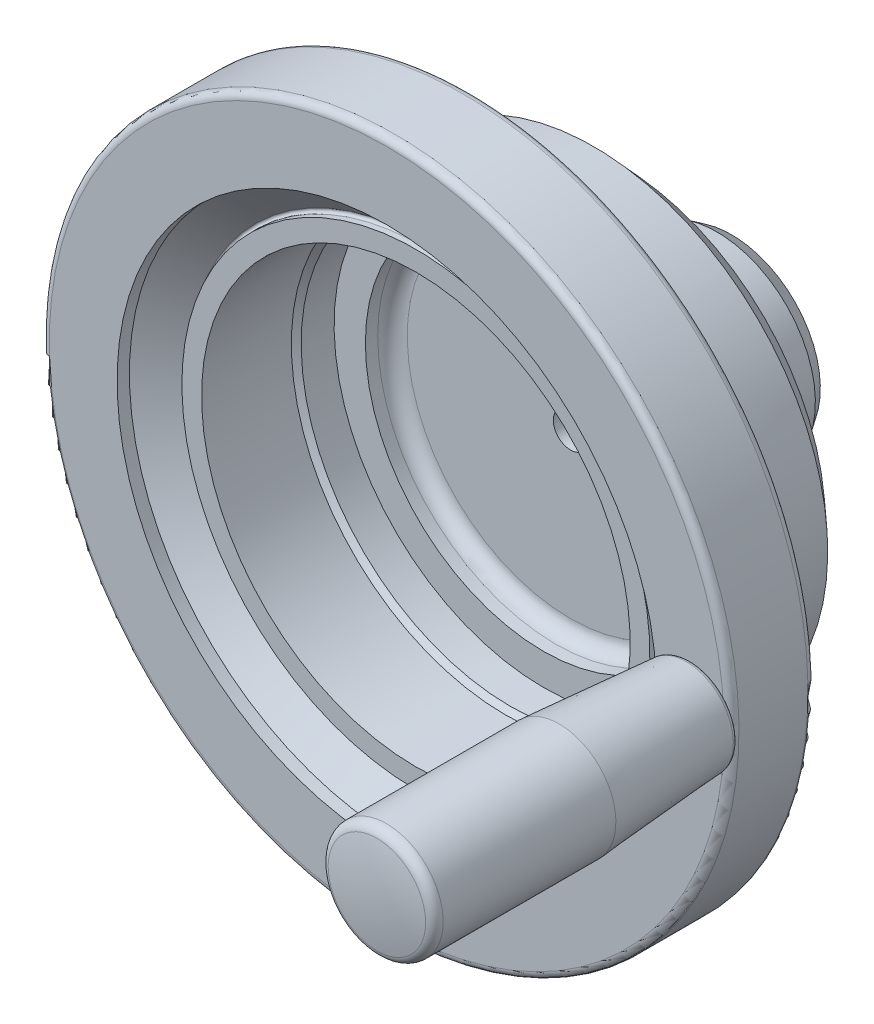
ISO-10303-21;
HEADER;
FILE_DESCRIPTION(('STEP AP214'),'2;1');
FILE_NAME('part.step','',(''),(''),'','','');
FILE_SCHEMA(('AUTOMOTIVE_DESIGN { 1 0 10303 214 1 1 1 1 }'));
ENDSEC;
DATA;
#1=APPLICATION_CONTEXT('core data for automotive mechanical design processes');
#2=APPLICATION_PROTOCOL_DEFINITION('international standard','automotive_design',2000,#1);
#3=PRODUCT_CONTEXT('',#1,'mechanical');
#4=PRODUCT('Part','Part','',(#3));
#5=PRODUCT_RELATED_PRODUCT_CATEGORY('part','',(#4));
#6=PRODUCT_DEFINITION_FORMATION('','',#4);
#7=PRODUCT_DEFINITION_CONTEXT('part definition',#1,'design');
#8=PRODUCT_DEFINITION('design','',#6,#7);
#9=PRODUCT_DEFINITION_SHAPE('','',#8);
#10=(LENGTH_UNIT() NAMED_UNIT(*) SI_UNIT(.MILLI.,.METRE.));
#11=(NAMED_UNIT(*) PLANE_ANGLE_UNIT() SI_UNIT($,.RADIAN.));
#12=(NAMED_UNIT(*) SI_UNIT($,.STERADIAN.) SOLID_ANGLE_UNIT());
#13=UNCERTAINTY_MEASURE_WITH_UNIT(LENGTH_MEASURE(1.E-05),#10,'distance_accuracy_value','');
#14=(GEOMETRIC_REPRESENTATION_CONTEXT(3) GLOBAL_UNCERTAINTY_ASSIGNED_CONTEXT((#13)) GLOBAL_UNIT_ASSIGNED_CONTEXT((#10,
#11,#12)) REPRESENTATION_CONTEXT('',''));
#15=CARTESIAN_POINT('',(0.,0.,0.));
#16=DIRECTION('',(0.,0.,1.));
#17=DIRECTION('',(1.,0.,0.));
#18=AXIS2_PLACEMENT_3D('',#15,#16,#17);
#19=CARTESIAN_POINT('',(0.,0.,64.1));
#20=DIRECTION('',(0.,0.,1.));
#21=DIRECTION('',(0.,-1.,0.));
#22=AXIS2_PLACEMENT_3D('',#19,#20,#21);
#23=PLANE('',#22);
#24=CARTESIAN_POINT('',(0.,0.,64.1));
#25=DIRECTION('',(0.,0.,1.));
#26=DIRECTION('',(0.,-1.,0.));
#27=AXIS2_PLACEMENT_3D('',#24,#25,#26);
#28=CIRCLE('',#27,47.5);
#29=CARTESIAN_POINT('',(0.,-47.5,64.1));
#30=VERTEX_POINT('',#29);
#31=EDGE_CURVE('E172',#30,#30,#28,.T.);
#32=ORIENTED_EDGE('',*,*,#31,.T.);
#33=EDGE_LOOP('',(#32));
#34=FACE_BOUND('',#33,.T.);
#35=CARTESIAN_POINT('',(0.,0.,64.1));
#36=DIRECTION('',(0.,0.,1.));
#37=DIRECTION('',(0.,-1.,0.));
#38=AXIS2_PLACEMENT_3D('',#35,#36,#37);
#39=CIRCLE('',#38,43.5);
#40=CARTESIAN_POINT('',(0.,-43.5,64.1));
#41=VERTEX_POINT('',#40);
#42=EDGE_CURVE('E54',#41,#41,#39,.F.);
#43=ORIENTED_EDGE('',*,*,#42,.T.);
#44=EDGE_LOOP('',(#43));
#45=FACE_BOUND('',#44,.T.);
#46=ADVANCED_FACE('F14',(#34,#45),#23,.T.);
#47=CARTESIAN_POINT('',(-68.5,0.,70.));
#48=DIRECTION('',(0.,0.,-1.));
#49=DIRECTION('',(0.,1.,0.));
#50=AXIS2_PLACEMENT_3D('',#47,#48,#49);
#51=PLANE('',#50);
#52=CARTESIAN_POINT('',(0.,0.,70.));
#53=DIRECTION('',(0.,0.,1.));
#54=DIRECTION('',(0.,-1.,0.));
#55=AXIS2_PLACEMENT_3D('',#52,#53,#54);
#56=CIRCLE('',#55,68.5);
#57=CARTESIAN_POINT('',(0.,-68.5,70.));
#58=VERTEX_POINT('',#57);
#59=EDGE_CURVE('E187',#58,#58,#56,.T.);
#60=ORIENTED_EDGE('',*,*,#59,.T.);
#61=EDGE_LOOP('',(#60));
#62=FACE_BOUND('',#61,.T.);
#63=CARTESIAN_POINT('',(0.,0.,70.));
#64=DIRECTION('',(0.,0.,1.));
#65=DIRECTION('',(0.,-1.,0.));
#66=AXIS2_PLACEMENT_3D('',#63,#64,#65);
#67=CIRCLE('',#66,54.75);
#68=CARTESIAN_POINT('',(0.,-54.75,70.));
#69=VERTEX_POINT('',#68);
#70=EDGE_CURVE('E184',#69,#69,#67,.T.);
#71=ORIENTED_EDGE('',*,*,#70,.F.);
#72=EDGE_LOOP('',(#71));
#73=FACE_BOUND('',#72,.T.);
#74=CARTESIAN_POINT('',(62.,0.,70.));
#75=DIRECTION('',(0.,0.,-1.));
#76=DIRECTION('',(0.,1.,0.));
#77=AXIS2_PLACEMENT_3D('',#74,#75,#76);
#78=CIRCLE('',#77,6.);
#79=CARTESIAN_POINT('',(62.,6.,70.));
#80=VERTEX_POINT('',#79);
#81=EDGE_CURVE('E22',#80,#80,#78,.F.);
#82=ORIENTED_EDGE('',*,*,#81,.F.);
#83=EDGE_LOOP('',(#82));
#84=FACE_BOUND('',#83,.T.);
#85=ADVANCED_FACE('F106',(#62,#73,#84),#51,.F.);
#86=CARTESIAN_POINT('',(0.,0.,54.5));
#87=DIRECTION('',(0.,0.,1.));
#88=DIRECTION('',(0.,-1.,0.));
#89=AXIS2_PLACEMENT_3D('',#86,#87,#88);
#90=TOROIDAL_SURFACE('',#89,68.5,1.5);
#91=CARTESIAN_POINT('',(0.,0.,53.));
#92=DIRECTION('',(0.,0.,1.));
#93=DIRECTION('',(0.,-1.,0.));
#94=AXIS2_PLACEMENT_3D('',#91,#92,#93);
#95=CIRCLE('',#94,68.5);
#96=CARTESIAN_POINT('',(0.,-68.5,53.));
#97=VERTEX_POINT('',#96);
#98=EDGE_CURVE('E39',#97,#97,#95,.T.);
#99=ORIENTED_EDGE('',*,*,#98,.T.);
#100=EDGE_LOOP('',(#99));
#101=FACE_BOUND('',#100,.T.);
#102=CARTESIAN_POINT('',(0.,0.,54.5));
#103=DIRECTION('',(0.,0.,1.));
#104=DIRECTION('',(0.,-1.,0.));
#105=AXIS2_PLACEMENT_3D('',#102,#103,#104);
#106=CIRCLE('',#105,70.);
#107=CARTESIAN_POINT('',(0.,-70.,54.5));
#108=VERTEX_POINT('',#107);
#109=EDGE_CURVE('E193',#108,#108,#106,.T.);
#110=ORIENTED_EDGE('',*,*,#109,.F.);
#111=EDGE_LOOP('',(#110));
#112=FACE_BOUND('',#111,.T.);
#113=ADVANCED_FACE('F16',(#101,#112),#90,.T.);
#114=CARTESIAN_POINT('',(-68.5,0.,53.));
#115=DIRECTION('',(0.,0.,-1.));
#116=DIRECTION('',(0.,1.,0.));
#117=AXIS2_PLACEMENT_3D('',#114,#115,#116);
#118=PLANE('',#117);
#119=CARTESIAN_POINT('',(0.,0.,53.));
#120=DIRECTION('',(0.,0.,1.));
#121=DIRECTION('',(0.,-1.,0.));
#122=AXIS2_PLACEMENT_3D('',#119,#120,#121);
#123=CIRCLE('',#122,50.2222222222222);
#124=CARTESIAN_POINT('',(0.,-50.2222222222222,53.));
#125=VERTEX_POINT('',#124);
#126=EDGE_CURVE('E35',#125,#125,#123,.T.);
#127=ORIENTED_EDGE('',*,*,#126,.T.);
#128=EDGE_LOOP('',(#127));
#129=FACE_BOUND('',#128,.T.);
#130=ORIENTED_EDGE('',*,*,#98,.F.);
#131=EDGE_LOOP('',(#130));
#132=FACE_BOUND('',#131,.T.);
#133=ADVANCED_FACE('F476',(#129,#132),#118,.T.);
#134=CARTESIAN_POINT('',(0.,0.,51.4));
#135=DIRECTION('',(0.,0.,1.));
#136=DIRECTION('',(0.,-1.,0.));
#137=AXIS2_PLACEMENT_3D('',#134,#135,#136);
#138=CONICAL_SURFACE('',#137,48.8,0.726642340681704);
#139=ORIENTED_EDGE('',*,*,#126,.F.);
#140=EDGE_LOOP('',(#139));
#141=FACE_BOUND('',#140,.T.);
#142=CARTESIAN_POINT('',(0.,0.,51.4));
#143=DIRECTION('',(0.,0.,1.));
#144=DIRECTION('',(0.,-1.,0.));
#145=AXIS2_PLACEMENT_3D('',#142,#143,#144);
#146=CIRCLE('',#145,48.8);
#147=CARTESIAN_POINT('',(-48.8,0.,51.4));
#148=VERTEX_POINT('',#147);
#149=EDGE_CURVE('E32',#148,#148,#146,.T.);
#150=ORIENTED_EDGE('',*,*,#149,.T.);
#151=EDGE_LOOP('',(#150));
#152=FACE_BOUND('',#151,.T.);
#153=ADVANCED_FACE('F34',(#141,#152),#138,.T.);
#154=CARTESIAN_POINT('',(0.,0.,28.));
#155=DIRECTION('',(0.,0.,1.));
#156=DIRECTION('',(0.,-1.,0.));
#157=AXIS2_PLACEMENT_3D('',#154,#155,#156);
#158=CONICAL_SURFACE('',#157,47.5,0.055498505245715);
#159=ORIENTED_EDGE('',*,*,#149,.F.);
#160=CARTESIAN_POINT('',(-48.701464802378,2.1565945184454,50.4854514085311));
#161=CARTESIAN_POINT('',(-48.7133604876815,2.03971612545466,50.6063072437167));
#162=CARTESIAN_POINT('',(-48.7247469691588,1.91254930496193,50.7174246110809));
#163=CARTESIAN_POINT('',(-48.7457318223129,1.64119431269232,50.916921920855));
#164=CARTESIAN_POINT('',(-48.7553281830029,1.49698729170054,51.0052763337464));
#165=CARTESIAN_POINT('',(-48.7720545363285,1.19569348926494,51.1565769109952));
#166=CARTESIAN_POINT('',(-48.7791850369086,1.03860936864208,51.2195283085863));
#167=CARTESIAN_POINT('',(-48.7904664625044,0.716044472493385,51.3181706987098));
#168=CARTESIAN_POINT('',(-48.7946181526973,0.550565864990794,51.3538686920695));
#169=CARTESIAN_POINT('',(-48.7996303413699,0.216622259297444,51.3968810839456));
#170=CARTESIAN_POINT('',(-48.8005046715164,0.0481728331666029,51.4043147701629));
#171=CARTESIAN_POINT('',(-48.798936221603,-0.28758493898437,51.3909068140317));
#172=CARTESIAN_POINT('',(-48.7964933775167,-0.454893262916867,51.3700646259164));
#173=CARTESIAN_POINT('',(-48.7884799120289,-0.783164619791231,51.3008137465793));
#174=CARTESIAN_POINT('',(-48.7829174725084,-0.944143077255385,51.2524771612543));
#175=CARTESIAN_POINT('',(-48.7690699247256,-1.25569036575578,51.1297027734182));
#176=CARTESIAN_POINT('',(-48.7607847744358,-1.40625903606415,51.055264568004));
#177=CARTESIAN_POINT('',(-48.7420380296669,-1.69330044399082,50.8821210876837));
#178=CARTESIAN_POINT('',(-48.7315689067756,-1.82972191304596,50.7833316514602));
#179=CARTESIAN_POINT('',(-48.7091817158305,-2.08408501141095,50.564427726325));
#180=CARTESIAN_POINT('',(-48.6972635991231,-2.20202601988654,50.4443125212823));
#181=CARTESIAN_POINT('',(-48.6726746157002,-2.41680896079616,50.1853564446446));
#182=CARTESIAN_POINT('',(-48.6599997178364,-2.51352212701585,50.046409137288));
#183=CARTESIAN_POINT('',(-48.6347350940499,-2.68225357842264,49.754243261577));
#184=CARTESIAN_POINT('',(-48.6221453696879,-2.75427141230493,49.6010244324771));
#185=CARTESIAN_POINT('',(-48.5977183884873,-2.87172498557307,49.2842009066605));
#186=CARTESIAN_POINT('',(-48.5858831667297,-2.91709133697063,49.1205703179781));
#187=CARTESIAN_POINT('',(-48.5635730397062,-2.979624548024,48.7879159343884));
#188=CARTESIAN_POINT('',(-48.5530981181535,-2.99679174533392,48.6188922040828));
#189=CARTESIAN_POINT('',(-48.5339243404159,-3.00238285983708,48.2806275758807));
#190=CARTESIAN_POINT('',(-48.5252217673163,-2.99086761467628,48.1113878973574));
#191=CARTESIAN_POINT('',(-48.50975874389,-2.93950169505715,47.7771737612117));
#192=CARTESIAN_POINT('',(-48.5029982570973,-2.89965155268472,47.6121992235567));
#193=CARTESIAN_POINT('',(-48.4914315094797,-2.79289860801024,47.2917857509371));
#194=CARTESIAN_POINT('',(-48.4866188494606,-2.72608585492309,47.1363170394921));
#195=CARTESIAN_POINT('',(-48.4787316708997,-2.56729149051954,46.8387659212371));
#196=CARTESIAN_POINT('',(-48.4756571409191,-2.47531004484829,46.6966834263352));
#197=CARTESIAN_POINT('',(-48.4709298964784,-2.26891243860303,46.4301227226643));
#198=CARTESIAN_POINT('',(-48.4692754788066,-2.1545233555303,46.3056235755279));
#199=CARTESIAN_POINT('',(-48.4669850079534,-1.90648322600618,46.0775647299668));
#200=CARTESIAN_POINT('',(-48.4663489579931,-1.77283211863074,45.9740050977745));
#201=CARTESIAN_POINT('',(-48.4656809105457,-1.48996987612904,45.7907071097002));
#202=CARTESIAN_POINT('',(-48.4656492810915,-1.3407493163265,45.7109832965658));
#203=CARTESIAN_POINT('',(-48.4658201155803,-1.03104724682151,45.577702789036));
#204=CARTESIAN_POINT('',(-48.4660225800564,-0.87056571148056,45.5241461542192));
#205=CARTESIAN_POINT('',(-48.4663873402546,-0.542800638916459,45.4446965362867));
#206=CARTESIAN_POINT('',(-48.466549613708,-0.375513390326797,45.4188188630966));
#207=CARTESIAN_POINT('',(-48.4666938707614,-0.0389686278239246,45.3955145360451));
#208=CARTESIAN_POINT('',(-48.4666758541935,0.130288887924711,45.3980879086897));
#209=CARTESIAN_POINT('',(-48.4664736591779,0.465975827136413,45.4316132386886));
#210=CARTESIAN_POINT('',(-48.4662894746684,0.632405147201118,45.4625662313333));
#211=CARTESIAN_POINT('',(-48.4659212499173,0.957705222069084,45.5519736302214));
#212=CARTESIAN_POINT('',(-48.4657372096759,1.11657597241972,45.6104280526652));
#213=CARTESIAN_POINT('',(-48.4656649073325,1.4222517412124,45.7531803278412));
#214=CARTESIAN_POINT('',(-48.4657766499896,1.56905656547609,45.8374785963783));
#215=CARTESIAN_POINT('',(-48.4666797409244,1.84642897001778,46.0295244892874));
#216=CARTESIAN_POINT('',(-48.4674710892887,1.97699654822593,46.1372721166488));
#217=CARTESIAN_POINT('',(-48.4701502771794,2.21815281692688,46.373121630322));
#218=CARTESIAN_POINT('',(-48.4720378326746,2.32874667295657,46.5012182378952));
#219=CARTESIAN_POINT('',(-48.4772975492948,2.52685519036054,46.7741356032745));
#220=CARTESIAN_POINT('',(-48.4806697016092,2.61436998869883,46.9189562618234));
#221=CARTESIAN_POINT('',(-48.4891933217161,2.76378504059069,47.2210722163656));
#222=CARTESIAN_POINT('',(-48.494343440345,2.82570463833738,47.3783579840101));
#223=CARTESIAN_POINT('',(-48.506576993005,2.9222876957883,47.7010072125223));
#224=CARTESIAN_POINT('',(-48.5136603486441,2.95695226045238,47.8663703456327));
#225=CARTESIAN_POINT('',(-48.529732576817,2.99808619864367,48.2004741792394));
#226=CARTESIAN_POINT('',(-48.5387214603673,3.00455540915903,48.3692148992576));
#227=CARTESIAN_POINT('',(-48.5583810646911,2.98915946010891,48.7053430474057));
#228=CARTESIAN_POINT('',(-48.5690522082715,2.96728716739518,48.8727301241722));
#229=CARTESIAN_POINT('',(-48.5916870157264,2.89576522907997,49.201874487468));
#230=CARTESIAN_POINT('',(-48.6036544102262,2.84603359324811,49.3636136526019));
#231=CARTESIAN_POINT('',(-48.6282565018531,2.72019273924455,49.676280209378));
#232=CARTESIAN_POINT('',(-48.6408904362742,2.64411313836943,49.8272195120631));
#233=CARTESIAN_POINT('',(-48.6616491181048,2.49902254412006,50.0633572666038));
#234=CARTESIAN_POINT('',(-48.6697894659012,2.43701599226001,50.1529367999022));
#235=CARTESIAN_POINT('',(-48.6858459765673,2.30364239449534,50.3248557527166));
#236=CARTESIAN_POINT('',(-48.6937621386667,2.23227531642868,50.4071951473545));
#237=CARTESIAN_POINT('',(-48.701464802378,2.1565945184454,50.4854514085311));
#238=B_SPLINE_CURVE_WITH_KNOTS('',3,(#160,#161,#162,#163,#164,#165,#166,#167,#168,#169,#170,
#171,#172,#173,#174,#175,#176,#177,#178,#179,#180,#181,#182,#183,#184,#185,#186,#187,#188,#189,
#190,#191,#192,#193,#194,#195,#196,#197,#198,#199,#200,#201,#202,#203,#204,#205,#206,#207,#208,
#209,#210,#211,#212,#213,#214,#215,#216,#217,#218,#219,#220,#221,#222,#223,#224,#225,#226,#227,
#228,#229,#230,#231,#232,#233,#234,#235,#236,#237),.UNSPECIFIED.,.T.,.F.,(4,2,2,2,2,2,2,2,2,2,2,
2,2,2,2,2,2,2,2,2,2,2,2,2,2,2,2,2,2,2,2,2,2,2,2,2,2,2,4),(0.,0.505247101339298,1.01105841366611,
1.51676547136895,2.02234257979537,2.5257835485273,3.0292342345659,3.53137063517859,
4.0335147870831,4.53741937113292,5.04134087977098,5.5482394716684,6.05514732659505,
6.56336914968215,7.07158488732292,7.57872357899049,8.08585274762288,8.59130205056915,
9.09674802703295,9.60158694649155,10.1064274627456,10.6115753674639,11.116724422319,
11.6221527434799,12.127581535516,12.6330287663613,13.1384762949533,13.6439319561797,
14.1493876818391,14.6547125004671,15.1600343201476,15.664973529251,16.169892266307,
16.6748139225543,17.1798626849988,17.6864056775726,18.1923811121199,18.5195362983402,
18.8466926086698),.UNSPECIFIED.);
#239=EDGE_CURVE('E9',#148,#148,#238,.T.);
#240=ORIENTED_EDGE('',*,*,#239,.T.);
#241=EDGE_LOOP('',(#159,#240));
#242=FACE_BOUND('',#241,.T.);
#243=CARTESIAN_POINT('',(0.,0.,28.));
#244=DIRECTION('',(0.,0.,1.));
#245=DIRECTION('',(0.,-1.,0.));
#246=AXIS2_PLACEMENT_3D('',#243,#244,#245);
#247=CIRCLE('',#246,47.5);
#248=CARTESIAN_POINT('',(0.,-47.5,28.));
#249=VERTEX_POINT('',#248);
#250=EDGE_CURVE('E36',#249,#249,#247,.T.);
#251=ORIENTED_EDGE('',*,*,#250,.T.);
#252=EDGE_LOOP('',(#251));
#253=FACE_BOUND('',#252,.T.);
#254=ADVANCED_FACE('F30',(#242,#253),#158,.T.);
#255=CARTESIAN_POINT('',(0.,0.,23.));
#256=DIRECTION('',(0.,0.,1.));
#257=DIRECTION('',(0.,-1.,0.));
#258=AXIS2_PLACEMENT_3D('',#255,#256,#257);
#259=CONICAL_SURFACE('',#258,42.,0.832981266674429);
#260=ORIENTED_EDGE('',*,*,#250,.F.);
#261=EDGE_LOOP('',(#260));
#262=FACE_BOUND('',#261,.T.);
#263=CARTESIAN_POINT('',(0.,0.,23.));
#264=DIRECTION('',(0.,0.,1.));
#265=DIRECTION('',(0.,-1.,0.));
#266=AXIS2_PLACEMENT_3D('',#263,#264,#265);
#267=CIRCLE('',#266,42.);
#268=CARTESIAN_POINT('',(0.,-42.,23.));
#269=VERTEX_POINT('',#268);
#270=EDGE_CURVE('E42',#269,#269,#267,.T.);
#271=ORIENTED_EDGE('',*,*,#270,.T.);
#272=EDGE_LOOP('',(#271));
#273=FACE_BOUND('',#272,.T.);
#274=ADVANCED_FACE('F146',(#262,#273),#259,.T.);
#275=CARTESIAN_POINT('',(-23.0960318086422,0.,23.));
#276=DIRECTION('',(0.,0.,1.));
#277=DIRECTION('',(0.,-1.,0.));
#278=AXIS2_PLACEMENT_3D('',#275,#276,#277);
#279=PLANE('',#278);
#280=ORIENTED_EDGE('',*,*,#270,.F.);
#281=EDGE_LOOP('',(#280));
#282=FACE_BOUND('',#281,.T.);
#283=CARTESIAN_POINT('',(0.,0.,23.));
#284=DIRECTION('',(0.,0.,1.));
#285=DIRECTION('',(0.,-1.,0.));
#286=AXIS2_PLACEMENT_3D('',#283,#284,#285);
#287=CIRCLE('',#286,23.0960318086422);
#288=CARTESIAN_POINT('',(0.,-23.0960318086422,23.));
#289=VERTEX_POINT('',#288);
#290=EDGE_CURVE('E159',#289,#289,#287,.T.);
#291=ORIENTED_EDGE('',*,*,#290,.T.);
#292=EDGE_LOOP('',(#291));
#293=FACE_BOUND('',#292,.T.);
#294=ADVANCED_FACE('F143',(#282,#293),#279,.F.);
#295=CARTESIAN_POINT('',(0.,0.,22.));
#296=DIRECTION('',(0.,0.,1.));
#297=DIRECTION('',(0.,-1.,0.));
#298=AXIS2_PLACEMENT_3D('',#295,#296,#297);
#299=TOROIDAL_SURFACE('',#298,23.0960318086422,1.);
#300=ORIENTED_EDGE('',*,*,#290,.F.);
#301=EDGE_LOOP('',(#300));
#302=FACE_BOUND('',#301,.T.);
#303=CARTESIAN_POINT('',(0.,0.,22.109340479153));
#304=DIRECTION('',(0.,0.,1.));
#305=DIRECTION('',(0.,-1.,0.));
#306=AXIS2_PLACEMENT_3D('',#303,#304,#305);
#307=CIRCLE('',#306,22.1020274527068);
#308=CARTESIAN_POINT('',(0.,-22.1020274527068,22.109340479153));
#309=VERTEX_POINT('',#308);
#310=EDGE_CURVE('E161',#309,#309,#307,.T.);
#311=ORIENTED_EDGE('',*,*,#310,.T.);
#312=EDGE_LOOP('',(#311));
#313=FACE_BOUND('',#312,.T.);
#314=ADVANCED_FACE('F139',(#302,#313),#299,.F.);
#315=CARTESIAN_POINT('',(0.,0.,3.));
#316=DIRECTION('',(0.,0.,1.));
#317=DIRECTION('',(0.,-1.,0.));
#318=AXIS2_PLACEMENT_3D('',#315,#316,#317);
#319=CONICAL_SURFACE('',#318,20.,0.109559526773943);
#320=ORIENTED_EDGE('',*,*,#310,.F.);
#321=EDGE_LOOP('',(#320));
#322=FACE_BOUND('',#321,.T.);
#323=CARTESIAN_POINT('',(0.,0.,3.));
#324=DIRECTION('',(0.,0.,1.));
#325=DIRECTION('',(0.,-1.,0.));
#326=AXIS2_PLACEMENT_3D('',#323,#324,#325);
#327=CIRCLE('',#326,20.);
#328=CARTESIAN_POINT('',(0.,-20.,3.));
#329=VERTEX_POINT('',#328);
#330=EDGE_CURVE('E166',#329,#329,#327,.T.);
#331=ORIENTED_EDGE('',*,*,#330,.T.);
#332=EDGE_LOOP('',(#331));
#333=FACE_BOUND('',#332,.T.);
#334=ADVANCED_FACE('F135',(#322,#333),#319,.T.);
#335=CARTESIAN_POINT('',(0.,0.,0.));
#336=DIRECTION('',(0.,0.,1.));
#337=DIRECTION('',(0.,-1.,0.));
#338=AXIS2_PLACEMENT_3D('',#335,#336,#337);
#339=CONICAL_SURFACE('',#338,18.,0.588002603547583);
#340=ORIENTED_EDGE('',*,*,#330,.F.);
#341=EDGE_LOOP('',(#340));
#342=FACE_BOUND('',#341,.T.);
#343=CARTESIAN_POINT('',(0.,0.,0.));
#344=DIRECTION('',(0.,0.,1.));
#345=DIRECTION('',(0.,-1.,0.));
#346=AXIS2_PLACEMENT_3D('',#343,#344,#345);
#347=CIRCLE('',#346,18.);
#348=CARTESIAN_POINT('',(0.,-18.,0.));
#349=VERTEX_POINT('',#348);
#350=EDGE_CURVE('E169',#349,#349,#347,.T.);
#351=ORIENTED_EDGE('',*,*,#350,.T.);
#352=EDGE_LOOP('',(#351));
#353=FACE_BOUND('',#352,.T.);
#354=ADVANCED_FACE('F131',(#342,#353),#339,.T.);
#355=CARTESIAN_POINT('',(0.,0.,0.));
#356=DIRECTION('',(0.,0.,1.));
#357=DIRECTION('',(0.,-1.,0.));
#358=AXIS2_PLACEMENT_3D('',#355,#356,#357);
#359=PLANE('',#358);
#360=CARTESIAN_POINT('',(0.,0.,0.));
#361=DIRECTION('',(0.,0.,-1.));
#362=DIRECTION('',(0.,1.,0.));
#363=AXIS2_PLACEMENT_3D('',#360,#361,#362);
#364=CIRCLE('',#363,3.5);
#365=CARTESIAN_POINT('',(0.,3.5,0.));
#366=VERTEX_POINT('',#365);
#367=EDGE_CURVE('E196',#366,#366,#364,.T.);
#368=ORIENTED_EDGE('',*,*,#367,.F.);
#369=EDGE_LOOP('',(#368));
#370=FACE_BOUND('',#369,.T.);
#371=ORIENTED_EDGE('',*,*,#350,.F.);
#372=EDGE_LOOP('',(#371));
#373=FACE_BOUND('',#372,.T.);
#374=ADVANCED_FACE('F124',(#370,#373),#359,.F.);
#375=CARTESIAN_POINT('',(0.,0.,82.571506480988));
#376=DIRECTION('',(0.,0.,1.));
#377=DIRECTION('',(0.,-1.,0.));
#378=AXIS2_PLACEMENT_3D('',#375,#376,#377);
#379=CYLINDRICAL_SURFACE('',#378,47.5);
#380=CARTESIAN_POINT('',(0.,0.,62.9179946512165));
#381=DIRECTION('',(0.,0.,1.));
#382=DIRECTION('',(0.,-1.,0.));
#383=AXIS2_PLACEMENT_3D('',#380,#381,#382);
#384=CIRCLE('',#383,47.5);
#385=CARTESIAN_POINT('',(0.,-47.5,62.9179946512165));
#386=VERTEX_POINT('',#385);
#387=EDGE_CURVE('E175',#386,#386,#384,.T.);
#388=ORIENTED_EDGE('',*,*,#387,.T.);
#389=EDGE_LOOP('',(#388));
#390=FACE_BOUND('',#389,.T.);
#391=ORIENTED_EDGE('',*,*,#31,.F.);
#392=EDGE_LOOP('',(#391));
#393=FACE_BOUND('',#392,.T.);
#394=ADVANCED_FACE('F120',(#390,#393),#379,.T.);
#395=CARTESIAN_POINT('',(0.,0.,62.9179946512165));
#396=DIRECTION('',(0.,0.,1.));
#397=DIRECTION('',(0.,-1.,0.));
#398=AXIS2_PLACEMENT_3D('',#395,#396,#397);
#399=TOROIDAL_SURFACE('',#398,48.,0.5);
#400=ORIENTED_EDGE('',*,*,#387,.F.);
#401=EDGE_LOOP('',(#400));
#402=FACE_BOUND('',#401,.T.);
#403=CARTESIAN_POINT('',(0.,0.,62.522292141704));
#404=DIRECTION('',(0.,0.,1.));
#405=DIRECTION('',(0.,-1.,0.));
#406=AXIS2_PLACEMENT_3D('',#403,#404,#405);
#407=CIRCLE('',#406,48.305646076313);
#408=CARTESIAN_POINT('',(0.,-48.305646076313,62.522292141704));
#409=VERTEX_POINT('',#408);
#410=EDGE_CURVE('E178',#409,#409,#407,.T.);
#411=ORIENTED_EDGE('',*,*,#410,.T.);
#412=EDGE_LOOP('',(#411));
#413=FACE_BOUND('',#412,.T.);
#414=ADVANCED_FACE('F116',(#402,#413),#399,.F.);
#415=CARTESIAN_POINT('',(0.,0.,67.5));
#416=DIRECTION('',(0.,0.,1.));
#417=DIRECTION('',(0.,-1.,0.));
#418=AXIS2_PLACEMENT_3D('',#415,#416,#417);
#419=CONICAL_SURFACE('',#418,54.75,0.91310403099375);
#420=ORIENTED_EDGE('',*,*,#410,.F.);
#421=EDGE_LOOP('',(#420));
#422=FACE_BOUND('',#421,.T.);
#423=CARTESIAN_POINT('',(0.,0.,67.5));
#424=DIRECTION('',(0.,0.,1.));
#425=DIRECTION('',(0.,-1.,0.));
#426=AXIS2_PLACEMENT_3D('',#423,#424,#425);
#427=CIRCLE('',#426,54.75);
#428=CARTESIAN_POINT('',(0.,-54.75,67.5));
#429=VERTEX_POINT('',#428);
#430=EDGE_CURVE('E181',#429,#429,#427,.T.);
#431=ORIENTED_EDGE('',*,*,#430,.T.);
#432=EDGE_LOOP('',(#431));
#433=FACE_BOUND('',#432,.T.);
#434=ADVANCED_FACE('F112',(#422,#433),#419,.F.);
#435=CARTESIAN_POINT('',(0.,0.,82.571506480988));
#436=DIRECTION('',(0.,0.,1.));
#437=DIRECTION('',(0.,-1.,0.));
#438=AXIS2_PLACEMENT_3D('',#435,#436,#437);
#439=CYLINDRICAL_SURFACE('',#438,54.75);
#440=ORIENTED_EDGE('',*,*,#430,.F.);
#441=EDGE_LOOP('',(#440));
#442=FACE_BOUND('',#441,.T.);
#443=ORIENTED_EDGE('',*,*,#70,.T.);
#444=EDGE_LOOP('',(#443));
#445=FACE_BOUND('',#444,.T.);
#446=ADVANCED_FACE('F104',(#442,#445),#439,.F.);
#447=CARTESIAN_POINT('',(0.,0.,68.5));
#448=DIRECTION('',(0.,0.,1.));
#449=DIRECTION('',(0.,-1.,0.));
#450=AXIS2_PLACEMENT_3D('',#447,#448,#449);
#451=TOROIDAL_SURFACE('',#450,68.5,1.50000000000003);
#452=CARTESIAN_POINT('',(0.,0.,68.5));
#453=DIRECTION('',(0.,0.,1.));
#454=DIRECTION('',(0.,-1.,0.));
#455=AXIS2_PLACEMENT_3D('',#452,#453,#454);
#456=CIRCLE('',#455,70.);
#457=CARTESIAN_POINT('',(0.,-70.,68.5));
#458=VERTEX_POINT('',#457);
#459=EDGE_CURVE('E190',#458,#458,#456,.T.);
#460=ORIENTED_EDGE('',*,*,#459,.T.);
#461=EDGE_LOOP('',(#460));
#462=FACE_BOUND('',#461,.T.);
#463=ORIENTED_EDGE('',*,*,#59,.F.);
#464=EDGE_LOOP('',(#463));
#465=FACE_BOUND('',#464,.T.);
#466=ADVANCED_FACE('F100',(#462,#465),#451,.T.);
#467=CARTESIAN_POINT('',(0.,0.,82.571506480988));
#468=DIRECTION('',(0.,0.,1.));
#469=DIRECTION('',(0.,-1.,0.));
#470=AXIS2_PLACEMENT_3D('',#467,#468,#469);
#471=CYLINDRICAL_SURFACE('',#470,70.);
#472=ORIENTED_EDGE('',*,*,#459,.F.);
#473=EDGE_LOOP('',(#472));
#474=FACE_BOUND('',#473,.T.);
#475=ORIENTED_EDGE('',*,*,#109,.T.);
#476=EDGE_LOOP('',(#475));
#477=FACE_BOUND('',#476,.T.);
#478=ADVANCED_FACE('F96',(#474,#477),#471,.T.);
#479=CARTESIAN_POINT('',(0.,0.,29.));
#480=DIRECTION('',(0.,0.,-1.));
#481=DIRECTION('',(0.,1.,0.));
#482=AXIS2_PLACEMENT_3D('',#479,#480,#481);
#483=CYLINDRICAL_SURFACE('',#482,3.5);
#484=ORIENTED_EDGE('',*,*,#367,.T.);
#485=EDGE_LOOP('',(#484));
#486=FACE_BOUND('',#485,.T.);
#487=CARTESIAN_POINT('',(0.,0.,32.7));
#488=DIRECTION('',(0.,0.,1.));
#489=DIRECTION('',(0.,-1.,0.));
#490=AXIS2_PLACEMENT_3D('',#487,#488,#489);
#491=CIRCLE('',#490,3.5);
#492=CARTESIAN_POINT('',(0.,-3.5,32.7));
#493=VERTEX_POINT('',#492);
#494=EDGE_CURVE('E18',#493,#493,#491,.T.);
#495=ORIENTED_EDGE('',*,*,#494,.T.);
#496=EDGE_LOOP('',(#495));
#497=FACE_BOUND('',#496,.T.);
#498=ADVANCED_FACE('F92',(#486,#497),#483,.F.);
#499=CARTESIAN_POINT('',(62.,0.,85.));
#500=DIRECTION('',(0.,-1.,0.));
#501=DIRECTION('',(0.,0.,-1.));
#502=AXIS2_PLACEMENT_3D('',#499,#500,#501);
#503=SPHERICAL_SURFACE('',#502,50.);
#504=CARTESIAN_POINT('',(62.,0.,85.));
#505=DIRECTION('',(0.,0.,1.));
#506=DIRECTION('',(0.,-1.,0.));
#507=AXIS2_PLACEMENT_3D('',#504,#505,#506);
#508=SPHERICAL_SURFACE('',#507,50.);
#509=CARTESIAN_POINT('',(62.,0.,134.010942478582));
#510=DIRECTION('',(0.,0.,1.));
#511=DIRECTION('',(0.,-1.,0.));
#512=AXIS2_PLACEMENT_3D('',#509,#510,#511);
#513=CIRCLE('',#512,9.8958333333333);
#514=CARTESIAN_POINT('',(62.,-9.8958333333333,134.010942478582));
#515=VERTEX_POINT('',#514);
#516=EDGE_CURVE('E199',#515,#515,#513,.T.);
#517=ORIENTED_EDGE('',*,*,#516,.T.);
#518=EDGE_LOOP('',(#517));
#519=FACE_BOUND('',#518,.T.);
#520=ADVANCED_FACE('F88',(#519),#508,.T.);
#521=CARTESIAN_POINT('',(62.,0.,132.050504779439));
#522=DIRECTION('',(0.,0.,1.));
#523=DIRECTION('',(0.,-1.,0.));
#524=AXIS2_PLACEMENT_3D('',#521,#522,#523);
#525=TOROIDAL_SURFACE('',#524,9.5,2.);
#526=CARTESIAN_POINT('',(62.,0.,132.050504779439));
#527=DIRECTION('',(0.,0.,1.));
#528=DIRECTION('',(0.,-1.,0.));
#529=AXIS2_PLACEMENT_3D('',#526,#527,#528);
#530=CIRCLE('',#529,11.5);
#531=CARTESIAN_POINT('',(62.,-11.5,132.050504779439));
#532=VERTEX_POINT('',#531);
#533=EDGE_CURVE('E202',#532,#532,#530,.T.);
#534=ORIENTED_EDGE('',*,*,#533,.T.);
#535=EDGE_LOOP('',(#534));
#536=FACE_BOUND('',#535,.T.);
#537=ORIENTED_EDGE('',*,*,#516,.F.);
#538=EDGE_LOOP('',(#537));
#539=FACE_BOUND('',#538,.T.);
#540=ADVANCED_FACE('F84',(#536,#539),#525,.T.);
#541=CARTESIAN_POINT('',(62.,0.,138.792874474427));
#542=DIRECTION('',(0.,0.,1.));
#543=DIRECTION('',(0.,-1.,0.));
#544=AXIS2_PLACEMENT_3D('',#541,#542,#543);
#545=CYLINDRICAL_SURFACE('',#544,11.5);
#546=CARTESIAN_POINT('',(62.,0.,97.));
#547=DIRECTION('',(0.,0.,1.));
#548=DIRECTION('',(0.,-1.,0.));
#549=AXIS2_PLACEMENT_3D('',#546,#547,#548);
#550=CIRCLE('',#549,11.5);
#551=CARTESIAN_POINT('',(62.,-11.5,97.));
#552=VERTEX_POINT('',#551);
#553=EDGE_CURVE('E205',#552,#552,#550,.T.);
#554=ORIENTED_EDGE('',*,*,#553,.T.);
#555=EDGE_LOOP('',(#554));
#556=FACE_BOUND('',#555,.T.);
#557=ORIENTED_EDGE('',*,*,#533,.F.);
#558=EDGE_LOOP('',(#557));
#559=FACE_BOUND('',#558,.T.);
#560=ADVANCED_FACE('F80',(#556,#559),#545,.T.);
#561=CARTESIAN_POINT('',(62.,0.,71.22530290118));
#562=DIRECTION('',(0.,0.,1.));
#563=DIRECTION('',(0.,-1.,0.));
#564=AXIS2_PLACEMENT_3D('',#561,#562,#563);
#565=CONICAL_SURFACE('',#564,9.56931107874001,0.0747667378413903);
#566=ORIENTED_EDGE('',*,*,#553,.F.);
#567=EDGE_LOOP('',(#566));
#568=FACE_BOUND('',#567,.T.);
#569=CARTESIAN_POINT('',(62.,0.,71.22530290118));
#570=DIRECTION('',(0.,0.,1.));
#571=DIRECTION('',(0.,-1.,0.));
#572=AXIS2_PLACEMENT_3D('',#569,#570,#571);
#573=CIRCLE('',#572,9.56931107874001);
#574=CARTESIAN_POINT('',(62.,-9.56931107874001,71.22530290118));
#575=VERTEX_POINT('',#574);
#576=EDGE_CURVE('E208',#575,#575,#573,.T.);
#577=ORIENTED_EDGE('',*,*,#576,.T.);
#578=EDGE_LOOP('',(#577));
#579=FACE_BOUND('',#578,.T.);
#580=ADVANCED_FACE('F76',(#568,#579),#565,.T.);
#581=CARTESIAN_POINT('',(62.,0.,71.3));
#582=DIRECTION('',(0.,0.,1.));
#583=DIRECTION('',(0.,-1.,0.));
#584=AXIS2_PLACEMENT_3D('',#581,#582,#583);
#585=TOROIDAL_SURFACE('',#584,8.57210480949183,1.00000000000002);
#586=CARTESIAN_POINT('',(62.,0.,70.3));
#587=DIRECTION('',(0.,0.,1.));
#588=DIRECTION('',(0.,-1.,0.));
#589=AXIS2_PLACEMENT_3D('',#586,#587,#588);
#590=CIRCLE('',#589,8.57210480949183);
#591=CARTESIAN_POINT('',(62.,-8.57210480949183,70.3));
#592=VERTEX_POINT('',#591);
#593=EDGE_CURVE('E211',#592,#592,#590,.T.);
#594=ORIENTED_EDGE('',*,*,#593,.T.);
#595=EDGE_LOOP('',(#594));
#596=FACE_BOUND('',#595,.T.);
#597=ORIENTED_EDGE('',*,*,#576,.F.);
#598=EDGE_LOOP('',(#597));
#599=FACE_BOUND('',#598,.T.);
#600=ADVANCED_FACE('F72',(#596,#599),#585,.T.);
#601=CARTESIAN_POINT('',(56.,0.,70.3));
#602=DIRECTION('',(0.,0.,1.));
#603=DIRECTION('',(0.,-1.,0.));
#604=AXIS2_PLACEMENT_3D('',#601,#602,#603);
#605=PLANE('',#604);
#606=ORIENTED_EDGE('',*,*,#593,.F.);
#607=EDGE_LOOP('',(#606));
#608=FACE_BOUND('',#607,.T.);
#609=CARTESIAN_POINT('',(62.,0.,70.3));
#610=DIRECTION('',(0.,0.,1.));
#611=DIRECTION('',(0.,-1.,0.));
#612=AXIS2_PLACEMENT_3D('',#609,#610,#611);
#613=CIRCLE('',#612,6.);
#614=CARTESIAN_POINT('',(62.,-6.,70.3));
#615=VERTEX_POINT('',#614);
#616=EDGE_CURVE('E214',#615,#615,#613,.T.);
#617=ORIENTED_EDGE('',*,*,#616,.T.);
#618=EDGE_LOOP('',(#617));
#619=FACE_BOUND('',#618,.T.);
#620=ADVANCED_FACE('F68',(#608,#619),#605,.F.);
#621=CARTESIAN_POINT('',(62.,0.,138.792874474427));
#622=DIRECTION('',(0.,0.,1.));
#623=DIRECTION('',(0.,-1.,0.));
#624=AXIS2_PLACEMENT_3D('',#621,#622,#623);
#625=CYLINDRICAL_SURFACE('',#624,6.);
#626=ORIENTED_EDGE('',*,*,#616,.F.);
#627=EDGE_LOOP('',(#626));
#628=FACE_BOUND('',#627,.T.);
#629=ORIENTED_EDGE('',*,*,#81,.T.);
#630=EDGE_LOOP('',(#629));
#631=FACE_BOUND('',#630,.T.);
#632=ADVANCED_FACE('F63',(#628,#631),#625,.T.);
#633=CARTESIAN_POINT('',(-42.7231436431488,0.,48.4));
#634=DIRECTION('',(1.,0.,0.));
#635=DIRECTION('',(0.,-1.,0.));
#636=AXIS2_PLACEMENT_3D('',#633,#634,#635);
#637=CYLINDRICAL_SURFACE('',#636,3.);
#638=CARTESIAN_POINT('',(-45.6333333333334,0.,48.4));
#639=DIRECTION('',(1.,0.,0.));
#640=DIRECTION('',(0.,-1.,0.));
#641=AXIS2_PLACEMENT_3D('',#638,#639,#640);
#642=CIRCLE('',#641,3.);
#643=CARTESIAN_POINT('',(-45.6333333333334,-3.,48.4));
#644=VERTEX_POINT('',#643);
#645=EDGE_CURVE('E217',#644,#644,#642,.T.);
#646=ORIENTED_EDGE('',*,*,#645,.T.);
#647=EDGE_LOOP('',(#646));
#648=FACE_BOUND('',#647,.T.);
#649=ORIENTED_EDGE('',*,*,#239,.F.);
#650=EDGE_LOOP('',(#649));
#651=FACE_BOUND('',#650,.T.);
#652=ADVANCED_FACE('F26',(#648,#651),#637,.F.);
#653=CARTESIAN_POINT('',(-45.6333333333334,0.,51.4));
#654=DIRECTION('',(-1.,0.,0.));
#655=DIRECTION('',(0.,1.,0.));
#656=AXIS2_PLACEMENT_3D('',#653,#654,#655);
#657=PLANE('',#656);
#658=ORIENTED_EDGE('',*,*,#645,.F.);
#659=EDGE_LOOP('',(#658));
#660=FACE_BOUND('',#659,.T.);
#661=ADVANCED_FACE('F62',(#660),#657,.T.);
#662=CARTESIAN_POINT('',(0.,0.,44.8793135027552));
#663=DIRECTION('',(0.,0.,1.));
#664=DIRECTION('',(0.,-1.,0.));
#665=AXIS2_PLACEMENT_3D('',#662,#663,#664);
#666=CONICAL_SURFACE('',#665,42.5,0.785398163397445);
#667=CARTESIAN_POINT('',(0.,0.,45.8793135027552));
#668=DIRECTION('',(0.,0.,1.));
#669=DIRECTION('',(0.,-1.,0.));
#670=AXIS2_PLACEMENT_3D('',#667,#668,#669);
#671=CIRCLE('',#670,43.5);
#672=CARTESIAN_POINT('',(0.,-43.5,45.8793135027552));
#673=VERTEX_POINT('',#672);
#674=EDGE_CURVE('E235',#673,#673,#671,.T.);
#675=ORIENTED_EDGE('',*,*,#674,.T.);
#676=EDGE_LOOP('',(#675));
#677=FACE_BOUND('',#676,.T.);
#678=CARTESIAN_POINT('',(0.,0.,44.8793135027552));
#679=DIRECTION('',(0.,0.,1.));
#680=DIRECTION('',(0.,-1.,0.));
#681=AXIS2_PLACEMENT_3D('',#678,#679,#680);
#682=CIRCLE('',#681,42.5);
#683=CARTESIAN_POINT('',(0.,-42.5,44.8793135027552));
#684=VERTEX_POINT('',#683);
#685=EDGE_CURVE('E220',#684,#684,#682,.T.);
#686=ORIENTED_EDGE('',*,*,#685,.F.);
#687=EDGE_LOOP('',(#686));
#688=FACE_BOUND('',#687,.T.);
#689=ADVANCED_FACE('F269',(#677,#688),#666,.F.);
#690=CARTESIAN_POINT('',(0.,0.,128.923244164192));
#691=DIRECTION('',(0.,0.,1.));
#692=DIRECTION('',(0.,-1.,0.));
#693=AXIS2_PLACEMENT_3D('',#690,#691,#692);
#694=CYLINDRICAL_SURFACE('',#693,42.5);
#695=ORIENTED_EDGE('',*,*,#685,.T.);
#696=EDGE_LOOP('',(#695));
#697=FACE_BOUND('',#696,.T.);
#698=CARTESIAN_POINT('',(0.,0.,38.2));
#699=DIRECTION('',(0.,0.,1.));
#700=DIRECTION('',(0.,-1.,0.));
#701=AXIS2_PLACEMENT_3D('',#698,#699,#700);
#702=CIRCLE('',#701,42.5);
#703=CARTESIAN_POINT('',(0.,-42.5,38.2));
#704=VERTEX_POINT('',#703);
#705=EDGE_CURVE('E223',#704,#704,#702,.T.);
#706=ORIENTED_EDGE('',*,*,#705,.F.);
#707=EDGE_LOOP('',(#706));
#708=FACE_BOUND('',#707,.T.);
#709=ADVANCED_FACE('F266',(#697,#708),#694,.F.);
#710=CARTESIAN_POINT('',(0.,42.5,38.2));
#711=DIRECTION('',(0.,0.,1.));
#712=DIRECTION('',(0.,-1.,0.));
#713=AXIS2_PLACEMENT_3D('',#710,#711,#712);
#714=PLANE('',#713);
#715=ORIENTED_EDGE('',*,*,#705,.T.);
#716=EDGE_LOOP('',(#715));
#717=FACE_BOUND('',#716,.T.);
#718=CARTESIAN_POINT('',(0.,0.,38.2));
#719=DIRECTION('',(0.,0.,1.));
#720=DIRECTION('',(0.,-1.,0.));
#721=AXIS2_PLACEMENT_3D('',#718,#719,#720);
#722=CIRCLE('',#721,36.1496242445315);
#723=CARTESIAN_POINT('',(0.,-36.1496242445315,38.2));
#724=VERTEX_POINT('',#723);
#725=EDGE_CURVE('E226',#724,#724,#722,.T.);
#726=ORIENTED_EDGE('',*,*,#725,.F.);
#727=EDGE_LOOP('',(#726));
#728=FACE_BOUND('',#727,.T.);
#729=ADVANCED_FACE('F259',(#717,#728),#714,.T.);
#730=CARTESIAN_POINT('',(0.,0.,128.923244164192));
#731=DIRECTION('',(0.,0.,1.));
#732=DIRECTION('',(0.,-1.,0.));
#733=AXIS2_PLACEMENT_3D('',#730,#731,#732);
#734=CYLINDRICAL_SURFACE('',#733,36.1496242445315);
#735=ORIENTED_EDGE('',*,*,#725,.T.);
#736=EDGE_LOOP('',(#735));
#737=FACE_BOUND('',#736,.T.);
#738=CARTESIAN_POINT('',(0.,0.,35.7));
#739=DIRECTION('',(0.,0.,1.));
#740=DIRECTION('',(0.,-1.,0.));
#741=AXIS2_PLACEMENT_3D('',#738,#739,#740);
#742=CIRCLE('',#741,36.1496242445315);
#743=CARTESIAN_POINT('',(0.,-36.1496242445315,35.7));
#744=VERTEX_POINT('',#743);
#745=EDGE_CURVE('E229',#744,#744,#742,.T.);
#746=ORIENTED_EDGE('',*,*,#745,.F.);
#747=EDGE_LOOP('',(#746));
#748=FACE_BOUND('',#747,.T.);
#749=ADVANCED_FACE('F252',(#737,#748),#734,.F.);
#750=CARTESIAN_POINT('',(0.,0.,35.7));
#751=DIRECTION('',(0.,0.,1.));
#752=DIRECTION('',(0.,-1.,0.));
#753=AXIS2_PLACEMENT_3D('',#750,#751,#752);
#754=TOROIDAL_SURFACE('',#753,33.1496242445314,3.);
#755=ORIENTED_EDGE('',*,*,#745,.T.);
#756=EDGE_LOOP('',(#755));
#757=FACE_BOUND('',#756,.T.);
#758=CARTESIAN_POINT('',(0.,0.,32.7));
#759=DIRECTION('',(0.,0.,1.));
#760=DIRECTION('',(0.,-1.,0.));
#761=AXIS2_PLACEMENT_3D('',#758,#759,#760);
#762=CIRCLE('',#761,33.1496242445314);
#763=CARTESIAN_POINT('',(0.,-33.1496242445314,32.7));
#764=VERTEX_POINT('',#763);
#765=EDGE_CURVE('E232',#764,#764,#762,.T.);
#766=ORIENTED_EDGE('',*,*,#765,.F.);
#767=EDGE_LOOP('',(#766));
#768=FACE_BOUND('',#767,.T.);
#769=ADVANCED_FACE('F247',(#757,#768),#754,.F.);
#770=CARTESIAN_POINT('',(0.,33.1496242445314,32.7));
#771=DIRECTION('',(0.,0.,1.));
#772=DIRECTION('',(0.,-1.,0.));
#773=AXIS2_PLACEMENT_3D('',#770,#771,#772);
#774=PLANE('',#773);
#775=ORIENTED_EDGE('',*,*,#494,.F.);
#776=EDGE_LOOP('',(#775));
#777=FACE_BOUND('',#776,.T.);
#778=ORIENTED_EDGE('',*,*,#765,.T.);
#779=EDGE_LOOP('',(#778));
#780=FACE_BOUND('',#779,.T.);
#781=ADVANCED_FACE('F243',(#777,#780),#774,.T.);
#782=CARTESIAN_POINT('',(0.,0.,128.923244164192));
#783=DIRECTION('',(0.,0.,1.));
#784=DIRECTION('',(0.,-1.,0.));
#785=AXIS2_PLACEMENT_3D('',#782,#783,#784);
#786=CYLINDRICAL_SURFACE('',#785,43.5);
#787=ORIENTED_EDGE('',*,*,#42,.F.);
#788=EDGE_LOOP('',(#787));
#789=FACE_BOUND('',#788,.T.);
#790=ORIENTED_EDGE('',*,*,#674,.F.);
#791=EDGE_LOOP('',(#790));
#792=FACE_BOUND('',#791,.T.);
#793=ADVANCED_FACE('F246',(#789,#792),#786,.F.);
#794=CLOSED_SHELL('',(#46,#85,#113,#133,#153,#254,#274,#294,#314,#334,#354,#374,#394,#414,#434,
#446,#466,#478,#498,#520,#540,#560,#580,#600,#620,#632,#652,#661,#689,#709,#729,#749,#769,#781,#793));
#795=MANIFOLD_SOLID_BREP('B1',#794);
#796=ADVANCED_BREP_SHAPE_REPRESENTATION('',(#18,#795),#14);
#797=SHAPE_DEFINITION_REPRESENTATION(#9,#796);
ENDSEC;
END-ISO-10303-21;
